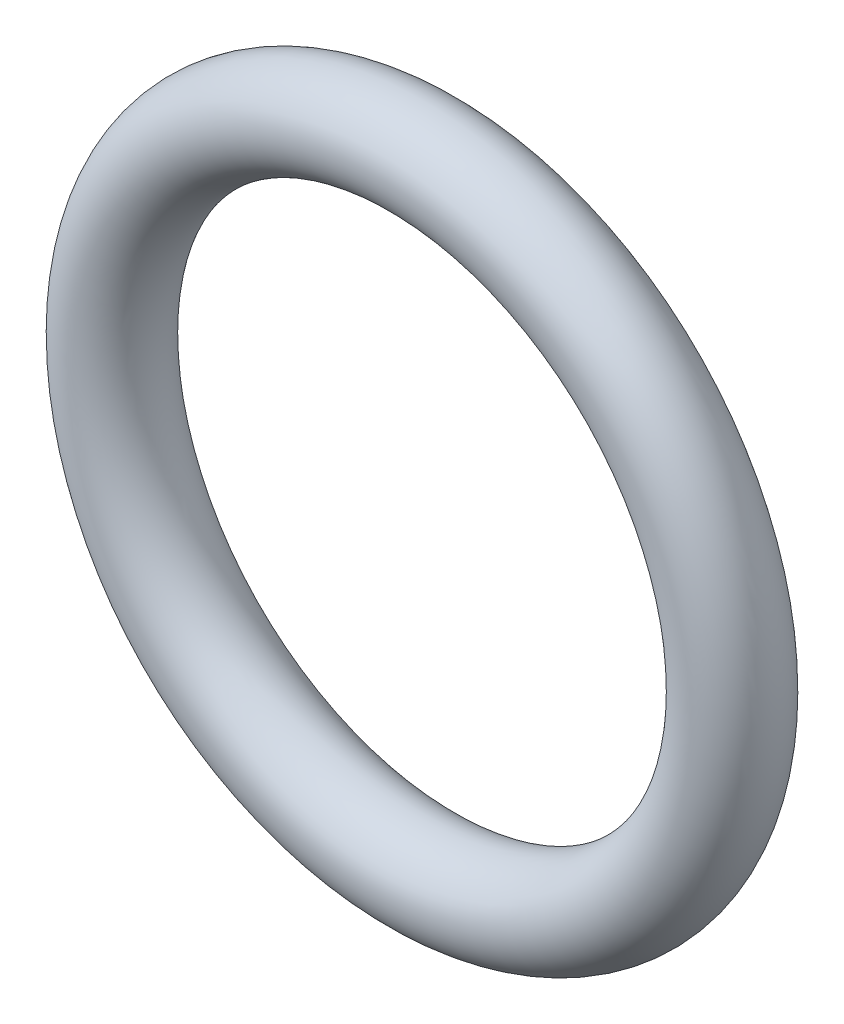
ISO-10303-21;
HEADER;
FILE_DESCRIPTION(('STEP AP214'),'2;1');
FILE_NAME('part.step','',(''),(''),'','','');
FILE_SCHEMA(('AUTOMOTIVE_DESIGN { 1 0 10303 214 1 1 1 1 }'));
ENDSEC;
DATA;
#1=APPLICATION_CONTEXT('core data for automotive mechanical design processes');
#2=APPLICATION_PROTOCOL_DEFINITION('international standard','automotive_design',2000,#1);
#3=PRODUCT_CONTEXT('',#1,'mechanical');
#4=PRODUCT('Part','Part','',(#3));
#5=PRODUCT_RELATED_PRODUCT_CATEGORY('part','',(#4));
#6=PRODUCT_DEFINITION_FORMATION('','',#4);
#7=PRODUCT_DEFINITION_CONTEXT('part definition',#1,'design');
#8=PRODUCT_DEFINITION('design','',#6,#7);
#9=PRODUCT_DEFINITION_SHAPE('','',#8);
#10=(LENGTH_UNIT() NAMED_UNIT(*) SI_UNIT(.MILLI.,.METRE.));
#11=(NAMED_UNIT(*) PLANE_ANGLE_UNIT() SI_UNIT($,.RADIAN.));
#12=(NAMED_UNIT(*) SI_UNIT($,.STERADIAN.) SOLID_ANGLE_UNIT());
#13=UNCERTAINTY_MEASURE_WITH_UNIT(LENGTH_MEASURE(1.E-05),#10,'distance_accuracy_value','');
#14=(GEOMETRIC_REPRESENTATION_CONTEXT(3) GLOBAL_UNCERTAINTY_ASSIGNED_CONTEXT((#13)) GLOBAL_UNIT_ASSIGNED_CONTEXT((#10,
#11,#12)) REPRESENTATION_CONTEXT('',''));
#15=CARTESIAN_POINT('',(0.,0.,0.));
#16=DIRECTION('',(0.,0.,1.));
#17=DIRECTION('',(1.,0.,0.));
#18=AXIS2_PLACEMENT_3D('',#15,#16,#17);
#19=CARTESIAN_POINT('',(0.,0.,0.));
#20=DIRECTION('',(0.,0.,-1.));
#21=DIRECTION('',(-1.,0.,0.));
#22=AXIS2_PLACEMENT_3D('',#19,#20,#21);
#23=TOROIDAL_SURFACE('',#22,5.,0.749999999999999);
#24=CARTESIAN_POINT('',(-5.75,0.,0.));
#25=VERTEX_POINT('',#24);
#26=VERTEX_LOOP('',#25);
#27=FACE_BOUND('',#26,.T.);
#28=ADVANCED_FACE('F26',(#27),#23,.T.);
#29=CLOSED_SHELL('',(#28));
#30=MANIFOLD_SOLID_BREP('B2',#29);
#31=ADVANCED_BREP_SHAPE_REPRESENTATION('',(#18,#30),#14);
#32=SHAPE_DEFINITION_REPRESENTATION(#9,#31);
ENDSEC;
END-ISO-10303-21;
